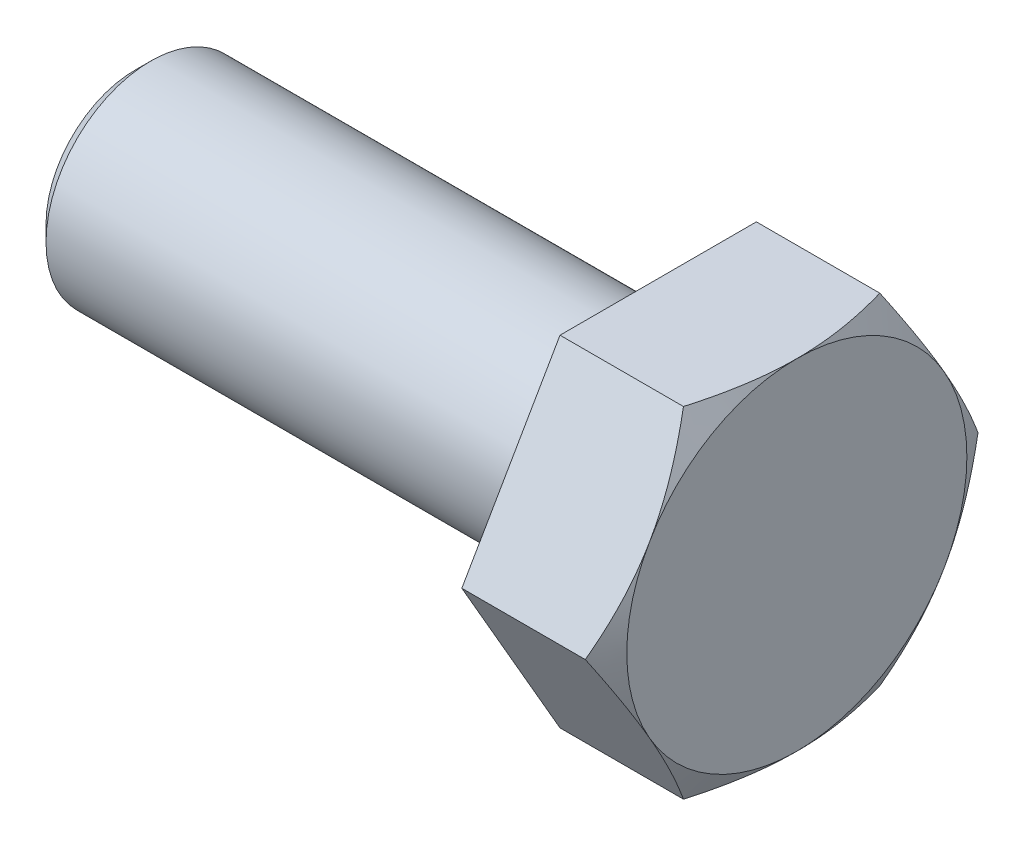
from build123d import *

# Parameters (mm, degrees)
BASE_EXTRUSION_DEPTH = 5.3
ESQUISSE2_R          = 4
BOSS_EXTRU_1_DEPTH   = 20
CHANFREIN1_SIZE      = 0.6


with BuildPart() as part:
    # Esquisse1 → Base-Extrusion (new body)
    with BuildSketch(Plane(origin=(0, 0, 0), x_dir=(0, 0, -1), z_dir=(1, 0, 0))):
        Polygon((7.505553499, 0), (3.75277675, 6.5), (-3.75277675, 6.5), (-7.505553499, 0), (-3.75277675, -6.5), (3.75277675, -6.5), align=None)
    extrude(amount=BASE_EXTRUSION_DEPTH)

    # Esquisse2 → Boss.-Extru.1 (add)
    with BuildSketch(Plane.ZY):
        Circle(ESQUISSE2_R)
    extrude(amount=BOSS_EXTRU_1_DEPTH)

    # Chanfrein1
    chanfrein1_edges = [part.edges().sort_by_distance(p)[0] for p in [
        (-20, 0, -4),
    ]]
    chamfer(chanfrein1_edges, length=CHANFREIN1_SIZE)

    # Esquisse3 → Enl_vement de mati_re-R_volution1 (revolve, cut)
    with BuildSketch(Plane.XY):
        Polygon((5.3, -6.5), (0, -15.67986928), (5.3, -15.67986928), align=None)
    revolve(axis=Axis((0, 0, 0), (1, 0, 0)), mode=Mode.SUBTRACT)


solid = part.part
